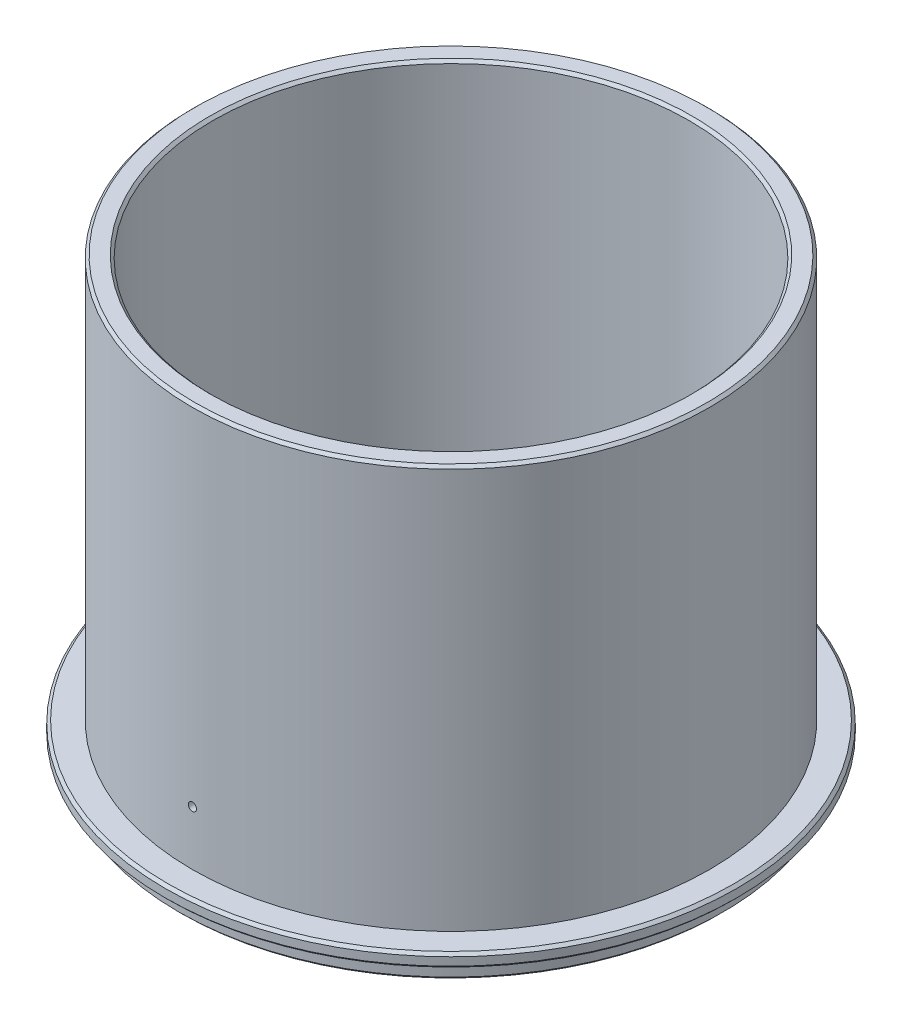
ISO-10303-21;
HEADER;
FILE_DESCRIPTION(('STEP AP214'),'2;1');
FILE_NAME('part.step','',(''),(''),'','','');
FILE_SCHEMA(('AUTOMOTIVE_DESIGN { 1 0 10303 214 1 1 1 1 }'));
ENDSEC;
DATA;
#1=APPLICATION_CONTEXT('core data for automotive mechanical design processes');
#2=APPLICATION_PROTOCOL_DEFINITION('international standard','automotive_design',2000,#1);
#3=PRODUCT_CONTEXT('',#1,'mechanical');
#4=PRODUCT('Part','Part','',(#3));
#5=PRODUCT_RELATED_PRODUCT_CATEGORY('part','',(#4));
#6=PRODUCT_DEFINITION_FORMATION('','',#4);
#7=PRODUCT_DEFINITION_CONTEXT('part definition',#1,'design');
#8=PRODUCT_DEFINITION('design','',#6,#7);
#9=PRODUCT_DEFINITION_SHAPE('','',#8);
#10=(LENGTH_UNIT() NAMED_UNIT(*) SI_UNIT(.MILLI.,.METRE.));
#11=(NAMED_UNIT(*) PLANE_ANGLE_UNIT() SI_UNIT($,.RADIAN.));
#12=(NAMED_UNIT(*) SI_UNIT($,.STERADIAN.) SOLID_ANGLE_UNIT());
#13=UNCERTAINTY_MEASURE_WITH_UNIT(LENGTH_MEASURE(1.E-05),#10,'distance_accuracy_value','');
#14=(GEOMETRIC_REPRESENTATION_CONTEXT(3) GLOBAL_UNCERTAINTY_ASSIGNED_CONTEXT((#13)) GLOBAL_UNIT_ASSIGNED_CONTEXT((#10,
#11,#12)) REPRESENTATION_CONTEXT('',''));
#15=CARTESIAN_POINT('',(0.,0.,0.));
#16=DIRECTION('',(0.,0.,1.));
#17=DIRECTION('',(1.,0.,0.));
#18=AXIS2_PLACEMENT_3D('',#15,#16,#17);
#19=CARTESIAN_POINT('',(0.,0.,0.));
#20=DIRECTION('',(0.,-1.,0.));
#21=DIRECTION('',(0.,0.,-1.));
#22=AXIS2_PLACEMENT_3D('',#19,#20,#21);
#23=CYLINDRICAL_SURFACE('',#22,100.);
#24=CARTESIAN_POINT('',(0.,1.,0.));
#25=DIRECTION('',(0.,-1.,0.));
#26=DIRECTION('',(0.,0.,-1.));
#27=AXIS2_PLACEMENT_3D('',#24,#25,#26);
#28=CIRCLE('',#27,100.);
#29=CARTESIAN_POINT('',(0.,1.,-100.));
#30=VERTEX_POINT('',#29);
#31=EDGE_CURVE('E10',#30,#30,#28,.F.);
#32=ORIENTED_EDGE('',*,*,#31,.T.);
#33=EDGE_LOOP('',(#32));
#34=FACE_BOUND('',#33,.T.);
#35=CARTESIAN_POINT('',(0.,7.00000000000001,0.));
#36=DIRECTION('',(0.,-1.,0.));
#37=DIRECTION('',(0.,0.,-1.));
#38=AXIS2_PLACEMENT_3D('',#35,#36,#37);
#39=CIRCLE('',#38,100.);
#40=CARTESIAN_POINT('',(0.,7.00000000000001,-100.));
#41=VERTEX_POINT('',#40);
#42=EDGE_CURVE('E84',#41,#41,#39,.T.);
#43=ORIENTED_EDGE('',*,*,#42,.T.);
#44=EDGE_LOOP('',(#43));
#45=FACE_BOUND('',#44,.T.);
#46=ADVANCED_FACE('F39',(#34,#45),#23,.T.);
#47=CARTESIAN_POINT('',(0.,0.,-87.5));
#48=DIRECTION('',(0.,-1.,0.));
#49=DIRECTION('',(0.,0.,-1.));
#50=AXIS2_PLACEMENT_3D('',#47,#48,#49);
#51=PLANE('',#50);
#52=CARTESIAN_POINT('',(0.,0.,0.));
#53=DIRECTION('',(0.,-1.,0.));
#54=DIRECTION('',(0.,0.,-1.));
#55=AXIS2_PLACEMENT_3D('',#52,#53,#54);
#56=CIRCLE('',#55,99.);
#57=CARTESIAN_POINT('',(0.,0.,-99.));
#58=VERTEX_POINT('',#57);
#59=EDGE_CURVE('E46',#58,#58,#56,.T.);
#60=ORIENTED_EDGE('',*,*,#59,.T.);
#61=EDGE_LOOP('',(#60));
#62=FACE_BOUND('',#61,.T.);
#63=CARTESIAN_POINT('',(0.,0.,0.));
#64=DIRECTION('',(0.,-1.,0.));
#65=DIRECTION('',(0.,0.,-1.));
#66=AXIS2_PLACEMENT_3D('',#63,#64,#65);
#67=CIRCLE('',#66,87.5);
#68=CARTESIAN_POINT('',(0.,0.,-87.5));
#69=VERTEX_POINT('',#68);
#70=EDGE_CURVE('E78',#69,#69,#67,.T.);
#71=ORIENTED_EDGE('',*,*,#70,.F.);
#72=EDGE_LOOP('',(#71));
#73=FACE_BOUND('',#72,.T.);
#74=ADVANCED_FACE('F127',(#62,#73),#51,.T.);
#75=CARTESIAN_POINT('',(0.,0.,0.));
#76=DIRECTION('',(0.,-1.,0.));
#77=DIRECTION('',(0.,0.,-1.));
#78=AXIS2_PLACEMENT_3D('',#75,#76,#77);
#79=CYLINDRICAL_SURFACE('',#78,87.5);
#80=CARTESIAN_POINT('',(0.,159.,0.));
#81=DIRECTION('',(0.,1.,0.));
#82=DIRECTION('',(0.,0.,1.));
#83=AXIS2_PLACEMENT_3D('',#80,#81,#82);
#84=CIRCLE('',#83,87.5);
#85=CARTESIAN_POINT('',(0.,159.,87.5));
#86=VERTEX_POINT('',#85);
#87=EDGE_CURVE('E66',#86,#86,#84,.T.);
#88=ORIENTED_EDGE('',*,*,#87,.T.);
#89=EDGE_LOOP('',(#88));
#90=FACE_BOUND('',#89,.T.);
#91=CARTESIAN_POINT('',(1.49999999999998,32.,87.4871419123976));
#92=CARTESIAN_POINT('',(1.49999626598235,31.915750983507,87.4871420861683));
#93=CARTESIAN_POINT('',(1.49287828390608,31.8314410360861,87.4872649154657));
#94=CARTESIAN_POINT('',(1.46458227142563,31.6651435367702,87.4877430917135));
#95=CARTESIAN_POINT('',(1.44338735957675,31.5831588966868,87.4880987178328));
#96=CARTESIAN_POINT('',(1.38754144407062,31.4239452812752,87.4890021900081));
#97=CARTESIAN_POINT('',(1.35289691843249,31.3467140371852,87.4895499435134));
#98=CARTESIAN_POINT('',(1.27114423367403,31.1991855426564,87.4907758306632));
#99=CARTESIAN_POINT('',(1.22403915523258,31.1288865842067,87.4914539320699));
#100=CARTESIAN_POINT('',(1.11868787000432,30.9971790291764,87.4928643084));
#101=CARTESIAN_POINT('',(1.06043947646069,30.9357721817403,87.4935965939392));
#102=CARTESIAN_POINT('',(0.934457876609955,30.8236063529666,87.495032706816));
#103=CARTESIAN_POINT('',(0.866724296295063,30.7728477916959,87.49573653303));
#104=CARTESIAN_POINT('',(0.723693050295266,30.6834201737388,87.4970363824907));
#105=CARTESIAN_POINT('',(0.648395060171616,30.6447516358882,87.4976324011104));
#106=CARTESIAN_POINT('',(0.492374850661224,30.5806053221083,87.4986493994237));
#107=CARTESIAN_POINT('',(0.411652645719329,30.5551275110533,87.4990703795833));
#108=CARTESIAN_POINT('',(0.247083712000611,30.518088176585,87.4996898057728));
#109=CARTESIAN_POINT('',(0.163237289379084,30.5065252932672,87.4998882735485));
#110=CARTESIAN_POINT('',(-0.00520677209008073,30.4976398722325,87.5000403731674));
#111=CARTESIAN_POINT('',(-0.0898044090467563,30.5003172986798,87.4999940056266));
#112=CARTESIAN_POINT('',(-0.257340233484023,30.5198352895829,87.499661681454));
#113=CARTESIAN_POINT('',(-0.340278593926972,30.5366743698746,87.4993757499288));
#114=CARTESIAN_POINT('',(-0.502151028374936,30.5840353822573,87.4985965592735));
#115=CARTESIAN_POINT('',(-0.581085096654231,30.6145573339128,87.4981032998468));
#116=CARTESIAN_POINT('',(-0.732712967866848,30.6884193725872,87.4969650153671));
#117=CARTESIAN_POINT('',(-0.805406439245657,30.7317601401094,87.4963199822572));
#118=CARTESIAN_POINT('',(-0.942485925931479,30.8300289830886,87.4949508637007));
#119=CARTESIAN_POINT('',(-1.00687193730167,30.8849570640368,87.4942267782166));
#120=CARTESIAN_POINT('',(-1.12551748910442,31.0048497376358,87.4927810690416));
#121=CARTESIAN_POINT('',(-1.17977572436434,31.0698156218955,87.4920594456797));
#122=CARTESIAN_POINT('',(-1.27661546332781,31.2079351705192,87.4907001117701));
#123=CARTESIAN_POINT('',(-1.31919696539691,31.2810888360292,87.490062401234));
#124=CARTESIAN_POINT('',(-1.39147432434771,31.4335080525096,87.4889427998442));
#125=CARTESIAN_POINT('',(-1.42117014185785,31.5127736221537,87.4884609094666));
#126=CARTESIAN_POINT('',(-1.46683233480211,31.6751662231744,87.4877073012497));
#127=CARTESIAN_POINT('',(-1.48279872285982,31.7582932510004,87.4874355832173));
#128=CARTESIAN_POINT('',(-1.50054722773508,31.926037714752,87.4871329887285));
#129=CARTESIAN_POINT('',(-1.50233115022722,32.0106549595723,87.4871020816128));
#130=CARTESIAN_POINT('',(-1.49166878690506,32.1789878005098,87.4872845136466));
#131=CARTESIAN_POINT('',(-1.4792225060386,32.2627033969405,87.4874978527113));
#132=CARTESIAN_POINT('',(-1.44045454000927,32.4268514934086,87.4881446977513));
#133=CARTESIAN_POINT('',(-1.41413367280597,32.5072841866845,87.4885781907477));
#134=CARTESIAN_POINT('',(-1.34836453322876,32.6625891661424,87.4896164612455));
#135=CARTESIAN_POINT('',(-1.30891625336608,32.7374614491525,87.4902212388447));
#136=CARTESIAN_POINT('',(-1.21800744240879,32.8795285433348,87.4915339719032));
#137=CARTESIAN_POINT('',(-1.16654569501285,32.9467225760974,87.4922419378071));
#138=CARTESIAN_POINT('',(-1.05307255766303,33.0715179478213,87.4936811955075));
#139=CARTESIAN_POINT('',(-0.991061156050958,33.1291192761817,87.4944124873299));
#140=CARTESIAN_POINT('',(-0.858241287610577,33.2331001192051,87.4958160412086));
#141=CARTESIAN_POINT('',(-0.787431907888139,33.2794784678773,87.4964882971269));
#142=CARTESIAN_POINT('',(-0.639030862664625,33.3596888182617,87.4976979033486));
#143=CARTESIAN_POINT('',(-0.561439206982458,33.3935208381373,87.4982352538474));
#144=CARTESIAN_POINT('',(-0.401680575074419,33.4476761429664,87.4991144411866));
#145=CARTESIAN_POINT('',(-0.319513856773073,33.4680001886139,87.4994562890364));
#146=CARTESIAN_POINT('',(-0.152933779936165,33.4945651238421,87.4999059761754));
#147=CARTESIAN_POINT('',(-0.0685204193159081,33.5008060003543,87.5000138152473));
#148=CARTESIAN_POINT('',(0.100144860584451,33.4990273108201,87.4999833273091));
#149=CARTESIAN_POINT('',(0.184396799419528,33.4910095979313,87.4998450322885));
#150=CARTESIAN_POINT('',(0.350358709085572,33.4609451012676,87.4993379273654));
#151=CARTESIAN_POINT('',(0.432068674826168,33.4388982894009,87.4989691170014));
#152=CARTESIAN_POINT('',(0.590628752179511,33.3814013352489,87.4980425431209));
#153=CARTESIAN_POINT('',(0.667478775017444,33.3459509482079,87.497484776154));
#154=CARTESIAN_POINT('',(0.814133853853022,33.2626548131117,87.4962431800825));
#155=CARTESIAN_POINT('',(0.88393917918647,33.2148095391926,87.4955593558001));
#156=CARTESIAN_POINT('',(1.01452943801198,33.108080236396,87.4941426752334));
#157=CARTESIAN_POINT('',(1.07531415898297,33.0491959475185,87.4934098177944));
#158=CARTESIAN_POINT('',(1.18615089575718,32.9220411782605,87.4919775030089));
#159=CARTESIAN_POINT('',(1.23620024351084,32.8537683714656,87.4912780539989));
#160=CARTESIAN_POINT('',(1.32414849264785,32.7097578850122,87.4899912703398));
#161=CARTESIAN_POINT('',(1.36204090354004,32.6340162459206,87.4894039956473));
#162=CARTESIAN_POINT('',(1.42452801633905,32.4773044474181,87.4884089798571));
#163=CARTESIAN_POINT('',(1.44913863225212,32.3963406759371,87.4880010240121));
#164=CARTESIAN_POINT('',(1.47781642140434,32.2623853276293,87.4875200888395));
#165=CARTESIAN_POINT('',(1.48612485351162,32.2102638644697,87.4873788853));
#166=CARTESIAN_POINT('',(1.49721781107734,32.1054362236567,87.4871897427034));
#167=CARTESIAN_POINT('',(1.50000233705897,32.0527300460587,87.4871418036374));
#168=CARTESIAN_POINT('',(1.49999999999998,32.,87.4871419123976));
#169=B_SPLINE_CURVE_WITH_KNOTS('',3,(#91,#92,#93,#94,#95,#96,#97,#98,#99,#100,#101,#102,#103,
#104,#105,#106,#107,#108,#109,#110,#111,#112,#113,#114,#115,#116,#117,#118,#119,#120,#121,#122,
#123,#124,#125,#126,#127,#128,#129,#130,#131,#132,#133,#134,#135,#136,#137,#138,#139,#140,#141,
#142,#143,#144,#145,#146,#147,#148,#149,#150,#151,#152,#153,#154,#155,#156,#157,#158,#159,#160,
#161,#162,#163,#164,#165,#166,#167,#168),.UNSPECIFIED.,.T.,.F.,(4,2,2,2,2,2,2,2,2,2,2,2,2,2,2,2,
2,2,2,2,2,2,2,2,2,2,2,2,2,2,2,2,2,2,2,2,2,2,4),(0.,0.25255458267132,0.50541258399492,
0.758148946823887,1.01082288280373,1.26354645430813,1.51627999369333,1.76902437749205,
2.02176808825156,2.27448709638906,2.52720546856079,2.77989735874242,3.03258961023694,
3.28529527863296,3.53800106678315,3.79073939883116,4.04347776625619,4.29621690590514,
4.54895581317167,4.80166254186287,5.05436918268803,5.30706092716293,5.55975281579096,
5.81247029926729,6.06518806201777,6.31793206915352,6.57067571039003,6.82340511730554,
7.0761347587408,7.32883155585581,7.58152885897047,7.83423077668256,8.08692302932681,
8.33962123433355,8.59238216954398,8.84527782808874,9.09786979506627,9.25593948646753,
9.41400916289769),.UNSPECIFIED.);
#170=CARTESIAN_POINT('',(1.49999999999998,32.,87.4871419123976));
#171=VERTEX_POINT('',#170);
#172=EDGE_CURVE('E94',#171,#171,#169,.T.);
#173=ORIENTED_EDGE('',*,*,#172,.F.);
#174=EDGE_LOOP('',(#173));
#175=FACE_BOUND('',#174,.T.);
#176=ORIENTED_EDGE('',*,*,#70,.T.);
#177=EDGE_LOOP('',(#176));
#178=FACE_BOUND('',#177,.T.);
#179=ADVANCED_FACE('F132',(#90,#175,#178),#79,.F.);
#180=CARTESIAN_POINT('',(0.,160.,-95.));
#181=DIRECTION('',(0.,1.,0.));
#182=DIRECTION('',(0.,0.,1.));
#183=AXIS2_PLACEMENT_3D('',#180,#181,#182);
#184=PLANE('',#183);
#185=CARTESIAN_POINT('',(0.,160.,0.));
#186=DIRECTION('',(0.,1.,0.));
#187=DIRECTION('',(0.,0.,1.));
#188=AXIS2_PLACEMENT_3D('',#185,#186,#187);
#189=CIRCLE('',#188,94.);
#190=CARTESIAN_POINT('',(0.,160.,94.));
#191=VERTEX_POINT('',#190);
#192=EDGE_CURVE('E69',#191,#191,#189,.T.);
#193=ORIENTED_EDGE('',*,*,#192,.T.);
#194=EDGE_LOOP('',(#193));
#195=FACE_BOUND('',#194,.T.);
#196=CARTESIAN_POINT('',(0.,160.,0.));
#197=DIRECTION('',(0.,1.,0.));
#198=DIRECTION('',(0.,0.,1.));
#199=AXIS2_PLACEMENT_3D('',#196,#197,#198);
#200=CIRCLE('',#199,88.4999999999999);
#201=CARTESIAN_POINT('',(0.,160.,88.4999999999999));
#202=VERTEX_POINT('',#201);
#203=EDGE_CURVE('E72',#202,#202,#200,.F.);
#204=ORIENTED_EDGE('',*,*,#203,.T.);
#205=EDGE_LOOP('',(#204));
#206=FACE_BOUND('',#205,.T.);
#207=ADVANCED_FACE('F123',(#195,#206),#184,.T.);
#208=CARTESIAN_POINT('',(0.,0.,0.));
#209=DIRECTION('',(0.,-1.,0.));
#210=DIRECTION('',(0.,0.,-1.));
#211=AXIS2_PLACEMENT_3D('',#208,#209,#210);
#212=CYLINDRICAL_SURFACE('',#211,95.);
#213=CARTESIAN_POINT('',(0.,159.,0.));
#214=DIRECTION('',(0.,1.,0.));
#215=DIRECTION('',(0.,0.,1.));
#216=AXIS2_PLACEMENT_3D('',#213,#214,#215);
#217=CIRCLE('',#216,95.);
#218=CARTESIAN_POINT('',(0.,159.,95.));
#219=VERTEX_POINT('',#218);
#220=EDGE_CURVE('E75',#219,#219,#217,.F.);
#221=ORIENTED_EDGE('',*,*,#220,.T.);
#222=EDGE_LOOP('',(#221));
#223=FACE_BOUND('',#222,.T.);
#224=CARTESIAN_POINT('',(1.49999999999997,32.,94.9881571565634));
#225=CARTESIAN_POINT('',(1.49999626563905,32.0842500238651,94.9881573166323));
#226=CARTESIAN_POINT('',(1.49287811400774,32.1685610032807,94.9882704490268));
#227=CARTESIAN_POINT('',(1.46458138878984,32.3348606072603,94.9887108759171));
#228=CARTESIAN_POINT('',(1.44338592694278,32.4168463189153,94.9890384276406));
#229=CARTESIAN_POINT('',(1.38753846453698,32.5760620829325,94.9898705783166));
#230=CARTESIAN_POINT('',(1.3528929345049,32.653294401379,94.9903750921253));
#231=CARTESIAN_POINT('',(1.27113779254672,32.8008248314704,94.9915042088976));
#232=CARTESIAN_POINT('',(1.22403126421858,32.8711246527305,94.9921287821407));
#233=CARTESIAN_POINT('',(1.11867744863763,33.0028326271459,94.9934278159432));
#234=CARTESIAN_POINT('',(1.06042812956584,33.0642391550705,94.994102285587));
#235=CARTESIAN_POINT('',(0.934444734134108,33.176404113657,94.9954250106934));
#236=CARTESIAN_POINT('',(0.866710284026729,33.2271621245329,94.9960732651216));
#237=CARTESIAN_POINT('',(0.723678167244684,33.3165879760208,94.997270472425));
#238=CARTESIAN_POINT('',(0.648380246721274,33.355255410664,94.9978194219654));
#239=CARTESIAN_POINT('',(0.492360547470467,33.4193996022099,94.9987561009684));
#240=CARTESIAN_POINT('',(0.411638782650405,33.4448763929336,94.9991438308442));
#241=CARTESIAN_POINT('',(0.247069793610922,33.4819141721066,94.9997143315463));
#242=CARTESIAN_POINT('',(0.163222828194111,33.4934763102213,94.9998971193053));
#243=CARTESIAN_POINT('',(-0.00522215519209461,33.5023600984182,95.0000371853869));
#244=CARTESIAN_POINT('',(-0.0898201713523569,33.4996817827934,94.9999944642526));
#245=CARTESIAN_POINT('',(-0.257358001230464,33.4801617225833,94.9996883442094));
#246=CARTESIAN_POINT('',(-0.340297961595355,33.4633212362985,94.9994249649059));
#247=CARTESIAN_POINT('',(-0.502173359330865,33.4159568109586,94.9987072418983));
#248=CARTESIAN_POINT('',(-0.581108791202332,33.3854328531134,94.9982528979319));
#249=CARTESIAN_POINT('',(-0.732738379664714,33.3115665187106,94.9972044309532));
#250=CARTESIAN_POINT('',(-0.805432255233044,33.2682235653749,94.9966103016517));
#251=CARTESIAN_POINT('',(-0.942512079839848,33.1699500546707,94.9953492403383));
#252=CARTESIAN_POINT('',(-1.00689802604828,33.1150194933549,94.9946823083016));
#253=CARTESIAN_POINT('',(-1.12554166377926,32.9951229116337,94.9933507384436));
#254=CARTESIAN_POINT('',(-1.17979824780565,32.9301557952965,94.9926861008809));
#255=CARTESIAN_POINT('',(-1.27663446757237,32.7920341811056,94.9914341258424));
#256=CARTESIAN_POINT('',(-1.31921410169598,32.7188796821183,94.9908467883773));
#257=CARTESIAN_POINT('',(-1.39148758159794,32.5664593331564,94.9898156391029));
#258=CARTESIAN_POINT('',(-1.42118139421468,32.4871934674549,94.9893718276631));
#259=CARTESIAN_POINT('',(-1.46683961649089,32.3248007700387,94.9886777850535));
#260=CARTESIAN_POINT('',(-1.48280403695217,32.2416739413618,94.9884275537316));
#261=CARTESIAN_POINT('',(-1.50054894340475,32.0739286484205,94.9881489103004));
#262=CARTESIAN_POINT('',(-1.50233096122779,31.9893103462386,94.9881204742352));
#263=CARTESIAN_POINT('',(-1.49166446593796,31.8209757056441,94.9882885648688));
#264=CARTESIAN_POINT('',(-1.47921595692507,31.7372593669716,94.9884850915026));
#265=CARTESIAN_POINT('',(-1.44044304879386,31.5731093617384,94.9890809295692));
#266=CARTESIAN_POINT('',(-1.41411934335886,31.4926755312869,94.9894802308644));
#267=CARTESIAN_POINT('',(-1.34834399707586,31.3373687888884,94.9904365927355));
#268=CARTESIAN_POINT('',(-1.30889235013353,31.2624958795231,94.9909936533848));
#269=CARTESIAN_POINT('',(-1.21797707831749,31.12042932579,94.992202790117));
#270=CARTESIAN_POINT('',(-1.16651242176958,31.053236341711,94.9928548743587));
#271=CARTESIAN_POINT('',(-1.05303355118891,30.928443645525,94.9941805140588));
#272=CARTESIAN_POINT('',(-0.991019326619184,30.8708439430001,94.9948540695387));
#273=CARTESIAN_POINT('',(-0.858195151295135,30.766867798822,94.9961467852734));
#274=CARTESIAN_POINT('',(-0.787384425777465,30.7204923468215,94.9967659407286));
#275=CARTESIAN_POINT('',(-0.638981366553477,30.6402879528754,94.9978799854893));
#276=CARTESIAN_POINT('',(-0.561389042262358,30.6064589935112,94.9983748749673));
#277=CARTESIAN_POINT('',(-0.401629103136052,30.552309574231,94.9991845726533));
#278=CARTESIAN_POINT('',(-0.319461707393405,30.5319884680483,94.9994993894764));
#279=CARTESIAN_POINT('',(-0.152880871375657,30.5054294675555,94.9999134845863));
#280=CARTESIAN_POINT('',(-0.0684674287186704,30.4991915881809,95.0000127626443));
#281=CARTESIAN_POINT('',(0.100199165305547,30.5009762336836,94.9999845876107));
#282=CARTESIAN_POINT('',(0.184452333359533,30.5089971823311,94.99985715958));
#283=CARTESIAN_POINT('',(0.350416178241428,30.5390685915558,94.9993899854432));
#284=CARTESIAN_POINT('',(0.432126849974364,30.5611190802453,94.9990502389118));
#285=CARTESIAN_POINT('',(0.590687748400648,30.6186237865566,94.99819671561));
#286=CARTESIAN_POINT('',(0.667537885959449,30.654078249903,94.9976829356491));
#287=CARTESIAN_POINT('',(0.814192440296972,30.7373828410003,94.996539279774));
#288=CARTESIAN_POINT('',(0.883997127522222,30.785232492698,94.9959094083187));
#289=CARTESIAN_POINT('',(1.0145839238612,30.8919696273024,94.994604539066));
#290=CARTESIAN_POINT('',(1.07536599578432,30.9508571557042,94.9939295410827));
#291=CARTESIAN_POINT('',(1.18619685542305,31.0780179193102,94.9926103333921));
#292=CARTESIAN_POINT('',(1.2362429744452,31.1462934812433,94.9919661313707));
#293=CARTESIAN_POINT('',(1.32418387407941,31.2903081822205,94.9907810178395));
#294=CARTESIAN_POINT('',(1.36207226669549,31.366051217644,94.9902401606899));
#295=CARTESIAN_POINT('',(1.42455121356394,31.5227649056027,94.9893238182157));
#296=CARTESIAN_POINT('',(1.44915768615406,31.6037291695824,94.9889481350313));
#297=CARTESIAN_POINT('',(1.4778264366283,31.7376734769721,94.9885053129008));
#298=CARTESIAN_POINT('',(1.48613112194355,31.7897834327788,94.9883753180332));
#299=CARTESIAN_POINT('',(1.49721907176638,31.8945876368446,94.9882011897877));
#300=CARTESIAN_POINT('',(1.50000233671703,31.9472818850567,94.9881570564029));
#301=CARTESIAN_POINT('',(1.49999999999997,32.,94.9881571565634));
#302=B_SPLINE_CURVE_WITH_KNOTS('',3,(#224,#225,#226,#227,#228,#229,#230,#231,#232,#233,#234,
#235,#236,#237,#238,#239,#240,#241,#242,#243,#244,#245,#246,#247,#248,#249,#250,#251,#252,#253,
#254,#255,#256,#257,#258,#259,#260,#261,#262,#263,#264,#265,#266,#267,#268,#269,#270,#271,#272,
#273,#274,#275,#276,#277,#278,#279,#280,#281,#282,#283,#284,#285,#286,#287,#288,#289,#290,#291,
#292,#293,#294,#295,#296,#297,#298,#299,#300,#301),.UNSPECIFIED.,.T.,.F.,(4,2,2,2,2,2,2,2,2,2,2,
2,2,2,2,2,2,2,2,2,2,2,2,2,2,2,2,2,2,2,2,2,2,2,2,2,2,2,4),(0.,0.25255764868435,0.505418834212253,
0.758158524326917,1.01083572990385,1.26355905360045,1.51629233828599,1.76903410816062,
2.02177523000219,2.27449546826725,2.52721509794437,2.77991227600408,3.03260980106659,
3.28531869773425,3.53802768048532,3.79076427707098,4.04350090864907,4.29623819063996,
4.54897527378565,4.80168505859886,5.0543947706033,5.30709184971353,5.55978904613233,
5.81250795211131,6.06522711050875,6.31796854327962,6.57070962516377,6.82343861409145,
7.07616787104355,7.32886919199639,7.58157101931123,7.83427747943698,8.08697423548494,
8.33967203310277,8.59243257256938,8.84532570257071,9.09791506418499,9.25594901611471,
9.41398295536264),.UNSPECIFIED.);
#303=CARTESIAN_POINT('',(1.49999999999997,32.,94.9881571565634));
#304=VERTEX_POINT('',#303);
#305=EDGE_CURVE('E87',#304,#304,#302,.T.);
#306=ORIENTED_EDGE('',*,*,#305,.F.);
#307=EDGE_LOOP('',(#306));
#308=FACE_BOUND('',#307,.T.);
#309=CARTESIAN_POINT('',(0.,12.,0.));
#310=DIRECTION('',(0.,-1.,0.));
#311=DIRECTION('',(0.,0.,-1.));
#312=AXIS2_PLACEMENT_3D('',#309,#310,#311);
#313=CIRCLE('',#312,95.);
#314=CARTESIAN_POINT('',(0.,12.,-95.));
#315=VERTEX_POINT('',#314);
#316=EDGE_CURVE('E81',#315,#315,#313,.T.);
#317=ORIENTED_EDGE('',*,*,#316,.F.);
#318=EDGE_LOOP('',(#317));
#319=FACE_BOUND('',#318,.T.);
#320=ADVANCED_FACE('F98',(#223,#308,#319),#212,.T.);
#321=CARTESIAN_POINT('',(0.,12.,-105.));
#322=DIRECTION('',(0.,1.,0.));
#323=DIRECTION('',(0.,0.,1.));
#324=AXIS2_PLACEMENT_3D('',#321,#322,#323);
#325=PLANE('',#324);
#326=CARTESIAN_POINT('',(0.,12.,0.));
#327=DIRECTION('',(0.,1.,0.));
#328=DIRECTION('',(0.,0.,1.));
#329=AXIS2_PLACEMENT_3D('',#326,#327,#328);
#330=CIRCLE('',#329,104.);
#331=CARTESIAN_POINT('',(0.,12.,104.));
#332=VERTEX_POINT('',#331);
#333=EDGE_CURVE('E51',#332,#332,#330,.T.);
#334=ORIENTED_EDGE('',*,*,#333,.T.);
#335=EDGE_LOOP('',(#334));
#336=FACE_BOUND('',#335,.T.);
#337=ORIENTED_EDGE('',*,*,#316,.T.);
#338=EDGE_LOOP('',(#337));
#339=FACE_BOUND('',#338,.T.);
#340=ADVANCED_FACE('F116',(#336,#339),#325,.T.);
#341=CARTESIAN_POINT('',(0.,0.,0.));
#342=DIRECTION('',(0.,-1.,0.));
#343=DIRECTION('',(0.,0.,-1.));
#344=AXIS2_PLACEMENT_3D('',#341,#342,#343);
#345=CYLINDRICAL_SURFACE('',#344,105.);
#346=CARTESIAN_POINT('',(0.,8.00000000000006,0.));
#347=DIRECTION('',(0.,-1.,0.));
#348=DIRECTION('',(0.,0.,-1.));
#349=AXIS2_PLACEMENT_3D('',#346,#347,#348);
#350=CIRCLE('',#349,105.);
#351=CARTESIAN_POINT('',(0.,8.00000000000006,-105.));
#352=VERTEX_POINT('',#351);
#353=EDGE_CURVE('E55',#352,#352,#350,.F.);
#354=ORIENTED_EDGE('',*,*,#353,.T.);
#355=EDGE_LOOP('',(#354));
#356=FACE_BOUND('',#355,.T.);
#357=CARTESIAN_POINT('',(0.,11.,0.));
#358=DIRECTION('',(0.,1.,0.));
#359=DIRECTION('',(0.,0.,1.));
#360=AXIS2_PLACEMENT_3D('',#357,#358,#359);
#361=CIRCLE('',#360,105.);
#362=CARTESIAN_POINT('',(0.,11.,105.));
#363=VERTEX_POINT('',#362);
#364=EDGE_CURVE('E60',#363,#363,#361,.F.);
#365=ORIENTED_EDGE('',*,*,#364,.T.);
#366=EDGE_LOOP('',(#365));
#367=FACE_BOUND('',#366,.T.);
#368=ADVANCED_FACE('F113',(#356,#367),#345,.T.);
#369=CARTESIAN_POINT('',(0.,7.00000000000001,-100.));
#370=DIRECTION('',(0.,-1.,0.));
#371=DIRECTION('',(0.,0.,-1.));
#372=AXIS2_PLACEMENT_3D('',#369,#370,#371);
#373=PLANE('',#372);
#374=CARTESIAN_POINT('',(0.,7.00000000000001,0.));
#375=DIRECTION('',(0.,-1.,0.));
#376=DIRECTION('',(0.,0.,-1.));
#377=AXIS2_PLACEMENT_3D('',#374,#375,#376);
#378=CIRCLE('',#377,104.);
#379=CARTESIAN_POINT('',(0.,7.00000000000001,-104.));
#380=VERTEX_POINT('',#379);
#381=EDGE_CURVE('E63',#380,#380,#378,.T.);
#382=ORIENTED_EDGE('',*,*,#381,.T.);
#383=EDGE_LOOP('',(#382));
#384=FACE_BOUND('',#383,.T.);
#385=ORIENTED_EDGE('',*,*,#42,.F.);
#386=EDGE_LOOP('',(#385));
#387=FACE_BOUND('',#386,.T.);
#388=ADVANCED_FACE('F106',(#384,#387),#373,.T.);
#389=CARTESIAN_POINT('',(0.,32.,95.));
#390=DIRECTION('',(0.,0.,1.));
#391=DIRECTION('',(1.,0.,0.));
#392=AXIS2_PLACEMENT_3D('',#389,#390,#391);
#393=CYLINDRICAL_SURFACE('',#392,1.49999999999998);
#394=ORIENTED_EDGE('',*,*,#305,.T.);
#395=EDGE_LOOP('',(#394));
#396=FACE_BOUND('',#395,.T.);
#397=ORIENTED_EDGE('',*,*,#172,.T.);
#398=EDGE_LOOP('',(#397));
#399=FACE_BOUND('',#398,.T.);
#400=ADVANCED_FACE('F102',(#396,#399),#393,.F.);
#401=CARTESIAN_POINT('',(0.,159.,0.));
#402=DIRECTION('',(0.,-1.,0.));
#403=DIRECTION('',(0.,0.,-1.));
#404=AXIS2_PLACEMENT_3D('',#401,#402,#403);
#405=CONICAL_SURFACE('',#404,95.,0.785398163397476);
#406=ORIENTED_EDGE('',*,*,#192,.F.);
#407=EDGE_LOOP('',(#406));
#408=FACE_BOUND('',#407,.T.);
#409=ORIENTED_EDGE('',*,*,#220,.F.);
#410=EDGE_LOOP('',(#409));
#411=FACE_BOUND('',#410,.T.);
#412=ADVANCED_FACE('F105',(#408,#411),#405,.T.);
#413=CARTESIAN_POINT('',(0.,160.,0.));
#414=DIRECTION('',(0.,1.,0.));
#415=DIRECTION('',(0.,0.,1.));
#416=AXIS2_PLACEMENT_3D('',#413,#414,#415);
#417=CONICAL_SURFACE('',#416,88.4999999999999,0.785398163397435);
#418=ORIENTED_EDGE('',*,*,#87,.F.);
#419=EDGE_LOOP('',(#418));
#420=FACE_BOUND('',#419,.T.);
#421=ORIENTED_EDGE('',*,*,#203,.F.);
#422=EDGE_LOOP('',(#421));
#423=FACE_BOUND('',#422,.T.);
#424=ADVANCED_FACE('F139',(#420,#423),#417,.F.);
#425=CARTESIAN_POINT('',(0.,7.00000000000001,0.));
#426=DIRECTION('',(0.,1.,0.));
#427=DIRECTION('',(0.,0.,1.));
#428=AXIS2_PLACEMENT_3D('',#425,#426,#427);
#429=CONICAL_SURFACE('',#428,104.,0.785398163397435);
#430=ORIENTED_EDGE('',*,*,#353,.F.);
#431=EDGE_LOOP('',(#430));
#432=FACE_BOUND('',#431,.T.);
#433=ORIENTED_EDGE('',*,*,#381,.F.);
#434=EDGE_LOOP('',(#433));
#435=FACE_BOUND('',#434,.T.);
#436=ADVANCED_FACE('F143',(#432,#435),#429,.T.);
#437=CARTESIAN_POINT('',(0.,11.,0.));
#438=DIRECTION('',(0.,-1.,0.));
#439=DIRECTION('',(0.,0.,-1.));
#440=AXIS2_PLACEMENT_3D('',#437,#438,#439);
#441=CONICAL_SURFACE('',#440,105.,0.785398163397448);
#442=ORIENTED_EDGE('',*,*,#333,.F.);
#443=EDGE_LOOP('',(#442));
#444=FACE_BOUND('',#443,.T.);
#445=ORIENTED_EDGE('',*,*,#364,.F.);
#446=EDGE_LOOP('',(#445));
#447=FACE_BOUND('',#446,.T.);
#448=ADVANCED_FACE('F146',(#444,#447),#441,.T.);
#449=CARTESIAN_POINT('',(0.,0.,0.));
#450=DIRECTION('',(0.,1.,0.));
#451=DIRECTION('',(0.,0.,1.));
#452=AXIS2_PLACEMENT_3D('',#449,#450,#451);
#453=CONICAL_SURFACE('',#452,99.,0.785398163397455);
#454=ORIENTED_EDGE('',*,*,#31,.F.);
#455=EDGE_LOOP('',(#454));
#456=FACE_BOUND('',#455,.T.);
#457=ORIENTED_EDGE('',*,*,#59,.F.);
#458=EDGE_LOOP('',(#457));
#459=FACE_BOUND('',#458,.T.);
#460=ADVANCED_FACE('F41',(#456,#459),#453,.T.);
#461=CLOSED_SHELL('',(#46,#74,#179,#207,#320,#340,#368,#388,#400,#412,#424,#436,#448,#460));
#462=MANIFOLD_SOLID_BREP('B2',#461);
#463=ADVANCED_BREP_SHAPE_REPRESENTATION('',(#18,#462),#14);
#464=SHAPE_DEFINITION_REPRESENTATION(#9,#463);
ENDSEC;
END-ISO-10303-21;
